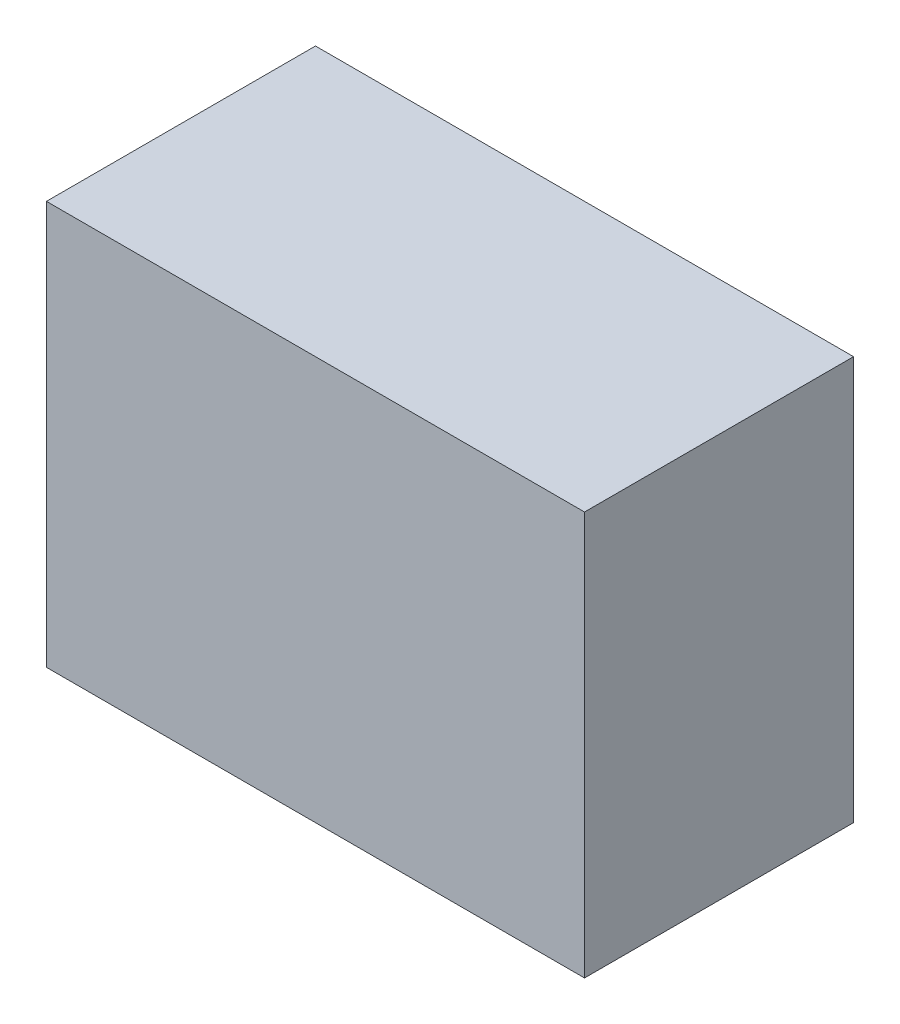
from build123d import *

# Parameters (mm, degrees)
SKETCH1_W           = 2
SKETCH1_H           = 1
BOSS_EXTRUDE1_DEPTH = 1.5


with BuildPart() as part:
    # Sketch1 → Boss-Extrude1 (new body)
    with BuildSketch(Plane(origin=(0, 0, 0), x_dir=(1, 0, 0), z_dir=(0, 1, 0))):
        Rectangle(SKETCH1_W, SKETCH1_H)
    extrude(amount=BOSS_EXTRUDE1_DEPTH)


solid = part.part
